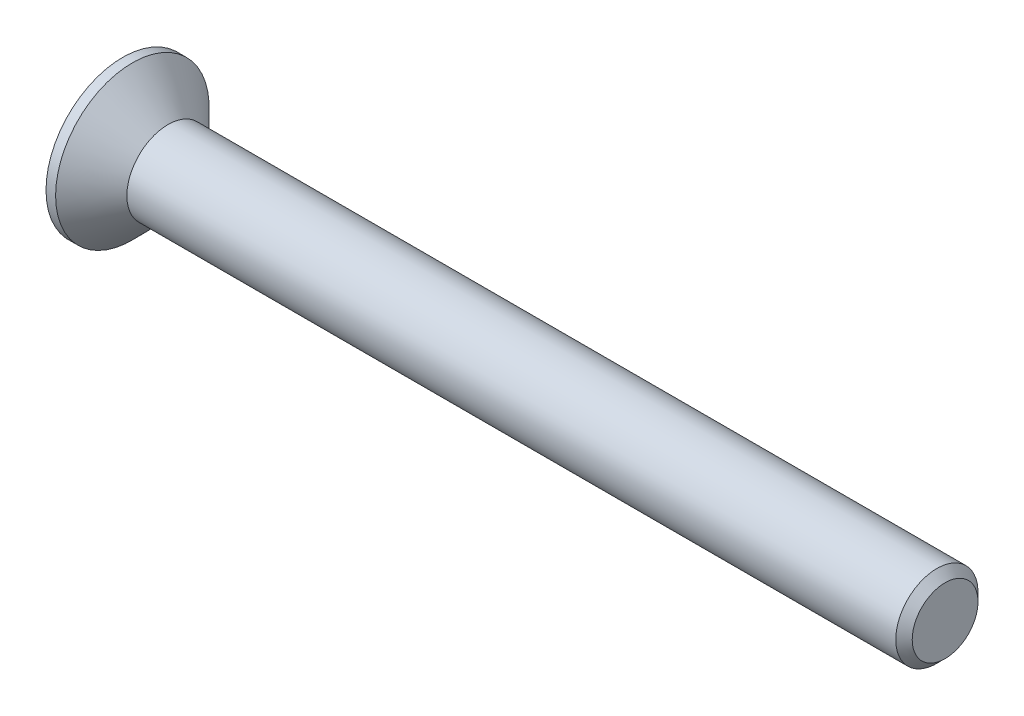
ISO-10303-21;
HEADER;
FILE_DESCRIPTION(('STEP AP214'),'2;1');
FILE_NAME('part.step','',(''),(''),'','','');
FILE_SCHEMA(('AUTOMOTIVE_DESIGN { 1 0 10303 214 1 1 1 1 }'));
ENDSEC;
DATA;
#1=APPLICATION_CONTEXT('core data for automotive mechanical design processes');
#2=APPLICATION_PROTOCOL_DEFINITION('international standard','automotive_design',2000,#1);
#3=PRODUCT_CONTEXT('',#1,'mechanical');
#4=PRODUCT('Part','Part','',(#3));
#5=PRODUCT_RELATED_PRODUCT_CATEGORY('part','',(#4));
#6=PRODUCT_DEFINITION_FORMATION('','',#4);
#7=PRODUCT_DEFINITION_CONTEXT('part definition',#1,'design');
#8=PRODUCT_DEFINITION('design','',#6,#7);
#9=PRODUCT_DEFINITION_SHAPE('','',#8);
#10=(LENGTH_UNIT() NAMED_UNIT(*) SI_UNIT(.MILLI.,.METRE.));
#11=(NAMED_UNIT(*) PLANE_ANGLE_UNIT() SI_UNIT($,.RADIAN.));
#12=(NAMED_UNIT(*) SI_UNIT($,.STERADIAN.) SOLID_ANGLE_UNIT());
#13=UNCERTAINTY_MEASURE_WITH_UNIT(LENGTH_MEASURE(1.E-05),#10,'distance_accuracy_value','');
#14=(GEOMETRIC_REPRESENTATION_CONTEXT(3) GLOBAL_UNCERTAINTY_ASSIGNED_CONTEXT((#13)) GLOBAL_UNIT_ASSIGNED_CONTEXT((#10,
#11,#12)) REPRESENTATION_CONTEXT('',''));
#15=CARTESIAN_POINT('',(0.,0.,0.));
#16=DIRECTION('',(0.,0.,1.));
#17=DIRECTION('',(1.,0.,0.));
#18=AXIS2_PLACEMENT_3D('',#15,#16,#17);
#19=CARTESIAN_POINT('',(0.,0.,0.));
#20=DIRECTION('',(-1.,0.,0.));
#21=DIRECTION('',(0.,0.,1.));
#22=AXIS2_PLACEMENT_3D('',#19,#20,#21);
#23=CONICAL_SURFACE('',#22,1.5,0.78539816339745);
#24=CARTESIAN_POINT('',(-1.3,0.,0.));
#25=DIRECTION('',(-1.,0.,0.));
#26=DIRECTION('',(0.,0.,1.));
#27=AXIS2_PLACEMENT_3D('',#24,#25,#26);
#28=CIRCLE('',#27,2.8);
#29=CARTESIAN_POINT('',(-1.3,0.,2.8));
#30=VERTEX_POINT('',#29);
#31=EDGE_CURVE('E189',#30,#30,#28,.T.);
#32=ORIENTED_EDGE('',*,*,#31,.F.);
#33=EDGE_LOOP('',(#32));
#34=FACE_BOUND('',#33,.T.);
#35=CARTESIAN_POINT('',(0.,0.,0.));
#36=DIRECTION('',(-1.,0.,0.));
#37=DIRECTION('',(0.,0.,1.));
#38=AXIS2_PLACEMENT_3D('',#35,#36,#37);
#39=CIRCLE('',#38,1.5);
#40=CARTESIAN_POINT('',(0.,0.,1.5));
#41=VERTEX_POINT('',#40);
#42=EDGE_CURVE('E212',#41,#41,#39,.T.);
#43=ORIENTED_EDGE('',*,*,#42,.T.);
#44=EDGE_LOOP('',(#43));
#45=FACE_BOUND('',#44,.T.);
#46=ADVANCED_FACE('F33',(#34,#45),#23,.T.);
#47=CARTESIAN_POINT('',(-1.65,0.,0.));
#48=DIRECTION('',(-1.,0.,0.));
#49=DIRECTION('',(0.,0.,1.));
#50=AXIS2_PLACEMENT_3D('',#47,#48,#49);
#51=CYLINDRICAL_SURFACE('',#50,1.5);
#52=CARTESIAN_POINT('',(28.05,0.,0.));
#53=DIRECTION('',(-1.,0.,0.));
#54=DIRECTION('',(0.,0.,1.));
#55=AXIS2_PLACEMENT_3D('',#52,#53,#54);
#56=CIRCLE('',#55,1.5);
#57=CARTESIAN_POINT('',(28.05,0.,1.5));
#58=VERTEX_POINT('',#57);
#59=EDGE_CURVE('E41',#58,#58,#56,.T.);
#60=ORIENTED_EDGE('',*,*,#59,.T.);
#61=EDGE_LOOP('',(#60));
#62=FACE_BOUND('',#61,.T.);
#63=ORIENTED_EDGE('',*,*,#42,.F.);
#64=EDGE_LOOP('',(#63));
#65=FACE_BOUND('',#64,.T.);
#66=ADVANCED_FACE('F217',(#62,#65),#51,.T.);
#67=CARTESIAN_POINT('',(28.35,0.,0.));
#68=DIRECTION('',(-1.,0.,0.));
#69=DIRECTION('',(0.,0.,1.));
#70=AXIS2_PLACEMENT_3D('',#67,#68,#69);
#71=PLANE('',#70);
#72=CARTESIAN_POINT('',(28.35,0.,0.));
#73=DIRECTION('',(-1.,0.,0.));
#74=DIRECTION('',(0.,0.,1.));
#75=AXIS2_PLACEMENT_3D('',#72,#73,#74);
#76=CIRCLE('',#75,1.19999999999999);
#77=CARTESIAN_POINT('',(28.35,0.,1.19999999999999));
#78=VERTEX_POINT('',#77);
#79=EDGE_CURVE('E11',#78,#78,#76,.F.);
#80=ORIENTED_EDGE('',*,*,#79,.T.);
#81=EDGE_LOOP('',(#80));
#82=FACE_BOUND('',#81,.T.);
#83=ADVANCED_FACE('F239',(#82),#71,.F.);
#84=CARTESIAN_POINT('',(-1.65,2.8,0.));
#85=DIRECTION('',(1.,0.,0.));
#86=DIRECTION('',(0.,0.,-1.));
#87=AXIS2_PLACEMENT_3D('',#84,#85,#86);
#88=PLANE('',#87);
#89=DIRECTION('',(0.,0.,-1.));
#90=VECTOR('',#89,1.);
#91=CARTESIAN_POINT('',(-1.65,0.365,-1.45));
#92=LINE('',#91,#90);
#93=CARTESIAN_POINT('',(-1.65,0.365,-0.365));
#94=VERTEX_POINT('',#93);
#95=CARTESIAN_POINT('',(-1.65,0.365,-1.45));
#96=VERTEX_POINT('',#95);
#97=EDGE_CURVE('E158',#94,#96,#92,.T.);
#98=ORIENTED_EDGE('',*,*,#97,.F.);
#99=DIRECTION('',(0.,-1.,0.));
#100=VECTOR('',#99,1.);
#101=CARTESIAN_POINT('',(-1.65,0.365,-0.365));
#102=LINE('',#101,#100);
#103=CARTESIAN_POINT('',(-1.65,1.45,-0.365));
#104=VERTEX_POINT('',#103);
#105=EDGE_CURVE('E48',#104,#94,#102,.T.);
#106=ORIENTED_EDGE('',*,*,#105,.F.);
#107=DIRECTION('',(0.,0.,-1.));
#108=VECTOR('',#107,1.);
#109=CARTESIAN_POINT('',(-1.65,1.45,-0.365));
#110=LINE('',#109,#108);
#111=CARTESIAN_POINT('',(-1.65,1.45,0.365));
#112=VERTEX_POINT('',#111);
#113=EDGE_CURVE('E185',#112,#104,#110,.T.);
#114=ORIENTED_EDGE('',*,*,#113,.F.);
#115=DIRECTION('',(0.,1.,0.));
#116=VECTOR('',#115,1.);
#117=CARTESIAN_POINT('',(-1.65,1.45,0.365));
#118=LINE('',#117,#116);
#119=CARTESIAN_POINT('',(-1.65,0.365,0.365));
#120=VERTEX_POINT('',#119);
#121=EDGE_CURVE('E183',#120,#112,#118,.T.);
#122=ORIENTED_EDGE('',*,*,#121,.F.);
#123=DIRECTION('',(0.,0.,-1.));
#124=VECTOR('',#123,1.);
#125=CARTESIAN_POINT('',(-1.65,0.365,0.365));
#126=LINE('',#125,#124);
#127=CARTESIAN_POINT('',(-1.65,0.365,1.45));
#128=VERTEX_POINT('',#127);
#129=EDGE_CURVE('E132',#128,#120,#126,.T.);
#130=ORIENTED_EDGE('',*,*,#129,.F.);
#131=DIRECTION('',(0.,1.,0.));
#132=VECTOR('',#131,1.);
#133=CARTESIAN_POINT('',(-1.65,0.365,1.45));
#134=LINE('',#133,#132);
#135=CARTESIAN_POINT('',(-1.65,-0.365,1.45));
#136=VERTEX_POINT('',#135);
#137=EDGE_CURVE('E179',#136,#128,#134,.T.);
#138=ORIENTED_EDGE('',*,*,#137,.F.);
#139=DIRECTION('',(0.,0.,1.));
#140=VECTOR('',#139,1.);
#141=CARTESIAN_POINT('',(-1.65,-0.365,1.45));
#142=LINE('',#141,#140);
#143=CARTESIAN_POINT('',(-1.65,-0.365,0.365));
#144=VERTEX_POINT('',#143);
#145=EDGE_CURVE('E176',#144,#136,#142,.T.);
#146=ORIENTED_EDGE('',*,*,#145,.F.);
#147=DIRECTION('',(0.,1.,0.));
#148=VECTOR('',#147,1.);
#149=CARTESIAN_POINT('',(-1.65,-0.365,0.365));
#150=LINE('',#149,#148);
#151=CARTESIAN_POINT('',(-1.65,-1.45,0.365));
#152=VERTEX_POINT('',#151);
#153=EDGE_CURVE('E173',#152,#144,#150,.T.);
#154=ORIENTED_EDGE('',*,*,#153,.F.);
#155=DIRECTION('',(0.,0.,1.));
#156=VECTOR('',#155,1.);
#157=CARTESIAN_POINT('',(-1.65,-1.45,0.365));
#158=LINE('',#157,#156);
#159=CARTESIAN_POINT('',(-1.65,-1.45,-0.365));
#160=VERTEX_POINT('',#159);
#161=EDGE_CURVE('E170',#160,#152,#158,.T.);
#162=ORIENTED_EDGE('',*,*,#161,.F.);
#163=DIRECTION('',(0.,-1.,0.));
#164=VECTOR('',#163,1.);
#165=CARTESIAN_POINT('',(-1.65,-1.45,-0.365));
#166=LINE('',#165,#164);
#167=CARTESIAN_POINT('',(-1.65,-0.365,-0.365));
#168=VERTEX_POINT('',#167);
#169=EDGE_CURVE('E167',#168,#160,#166,.T.);
#170=ORIENTED_EDGE('',*,*,#169,.F.);
#171=DIRECTION('',(0.,0.,1.));
#172=VECTOR('',#171,1.);
#173=CARTESIAN_POINT('',(-1.65,-0.365,-0.365));
#174=LINE('',#173,#172);
#175=CARTESIAN_POINT('',(-1.65,-0.365,-1.45));
#176=VERTEX_POINT('',#175);
#177=EDGE_CURVE('E164',#176,#168,#174,.T.);
#178=ORIENTED_EDGE('',*,*,#177,.F.);
#179=DIRECTION('',(0.,-1.,0.));
#180=VECTOR('',#179,1.);
#181=CARTESIAN_POINT('',(-1.65,-0.365,-1.45));
#182=LINE('',#181,#180);
#183=EDGE_CURVE('E161',#96,#176,#182,.T.);
#184=ORIENTED_EDGE('',*,*,#183,.F.);
#185=EDGE_LOOP('',(#98,#106,#114,#122,#130,#138,#146,#154,#162,#170,#178,#184));
#186=FACE_BOUND('',#185,.T.);
#187=CARTESIAN_POINT('',(-1.65,0.,0.));
#188=DIRECTION('',(-1.,0.,0.));
#189=DIRECTION('',(0.,0.,1.));
#190=AXIS2_PLACEMENT_3D('',#187,#188,#189);
#191=CIRCLE('',#190,2.8);
#192=CARTESIAN_POINT('',(-1.65,0.,2.8));
#193=VERTEX_POINT('',#192);
#194=EDGE_CURVE('E209',#193,#193,#191,.T.);
#195=ORIENTED_EDGE('',*,*,#194,.T.);
#196=EDGE_LOOP('',(#195));
#197=FACE_BOUND('',#196,.T.);
#198=ADVANCED_FACE('F230',(#186,#197),#88,.F.);
#199=CARTESIAN_POINT('',(-1.65,0.,0.));
#200=DIRECTION('',(-1.,0.,0.));
#201=DIRECTION('',(0.,0.,1.));
#202=AXIS2_PLACEMENT_3D('',#199,#200,#201);
#203=CYLINDRICAL_SURFACE('',#202,2.8);
#204=ORIENTED_EDGE('',*,*,#194,.F.);
#205=EDGE_LOOP('',(#204));
#206=FACE_BOUND('',#205,.T.);
#207=ORIENTED_EDGE('',*,*,#31,.T.);
#208=EDGE_LOOP('',(#207));
#209=FACE_BOUND('',#208,.T.);
#210=ADVANCED_FACE('F222',(#206,#209),#203,.T.);
#211=CARTESIAN_POINT('',(28.05,0.,0.));
#212=DIRECTION('',(-1.,0.,0.));
#213=DIRECTION('',(0.,0.,1.));
#214=AXIS2_PLACEMENT_3D('',#211,#212,#213);
#215=CONICAL_SURFACE('',#214,1.5,0.785398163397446);
#216=ORIENTED_EDGE('',*,*,#79,.F.);
#217=EDGE_LOOP('',(#216));
#218=FACE_BOUND('',#217,.T.);
#219=ORIENTED_EDGE('',*,*,#59,.F.);
#220=EDGE_LOOP('',(#219));
#221=FACE_BOUND('',#220,.T.);
#222=ADVANCED_FACE('F35',(#218,#221),#215,.T.);
#223=CARTESIAN_POINT('',(-0.4,0.365,-0.365));
#224=DIRECTION('',(0.,0.,-1.));
#225=DIRECTION('',(-1.,0.,0.));
#226=AXIS2_PLACEMENT_3D('',#223,#224,#225);
#227=PLANE('',#226);
#228=ORIENTED_EDGE('',*,*,#105,.T.);
#229=DIRECTION('',(-1.,0.,0.));
#230=VECTOR('',#229,1.);
#231=CARTESIAN_POINT('',(-0.4,0.365,-0.365));
#232=LINE('',#231,#230);
#233=CARTESIAN_POINT('',(-0.4,0.365,-0.365));
#234=VERTEX_POINT('',#233);
#235=EDGE_CURVE('E96',#234,#94,#232,.T.);
#236=ORIENTED_EDGE('',*,*,#235,.F.);
#237=DIRECTION('',(0.,-1.,0.));
#238=VECTOR('',#237,1.);
#239=CARTESIAN_POINT('',(-0.4,0.365,-0.365));
#240=LINE('',#239,#238);
#241=CARTESIAN_POINT('',(-0.4,1.45,-0.365));
#242=VERTEX_POINT('',#241);
#243=EDGE_CURVE('E187',#242,#234,#240,.T.);
#244=ORIENTED_EDGE('',*,*,#243,.F.);
#245=DIRECTION('',(-1.,0.,0.));
#246=VECTOR('',#245,1.);
#247=CARTESIAN_POINT('',(-0.4,1.45,-0.365));
#248=LINE('',#247,#246);
#249=EDGE_CURVE('E56',#242,#104,#248,.T.);
#250=ORIENTED_EDGE('',*,*,#249,.T.);
#251=EDGE_LOOP('',(#228,#236,#244,#250));
#252=FACE_BOUND('',#251,.T.);
#253=ADVANCED_FACE('F221',(#252),#227,.F.);
#254=CARTESIAN_POINT('',(-0.4,1.45,-0.365));
#255=DIRECTION('',(0.,1.,0.));
#256=DIRECTION('',(-1.,0.,0.));
#257=AXIS2_PLACEMENT_3D('',#254,#255,#256);
#258=PLANE('',#257);
#259=ORIENTED_EDGE('',*,*,#113,.T.);
#260=ORIENTED_EDGE('',*,*,#249,.F.);
#261=DIRECTION('',(0.,0.,-1.));
#262=VECTOR('',#261,1.);
#263=CARTESIAN_POINT('',(-0.4,1.45,-0.365));
#264=LINE('',#263,#262);
#265=CARTESIAN_POINT('',(-0.4,1.45,0.365));
#266=VERTEX_POINT('',#265);
#267=EDGE_CURVE('E144',#266,#242,#264,.T.);
#268=ORIENTED_EDGE('',*,*,#267,.F.);
#269=DIRECTION('',(-1.,0.,0.));
#270=VECTOR('',#269,1.);
#271=CARTESIAN_POINT('',(-0.4,1.45,0.365));
#272=LINE('',#271,#270);
#273=EDGE_CURVE('E136',#266,#112,#272,.T.);
#274=ORIENTED_EDGE('',*,*,#273,.T.);
#275=EDGE_LOOP('',(#259,#260,#268,#274));
#276=FACE_BOUND('',#275,.T.);
#277=ADVANCED_FACE('F228',(#276),#258,.F.);
#278=CARTESIAN_POINT('',(-0.4,1.45,0.365));
#279=DIRECTION('',(0.,0.,1.));
#280=DIRECTION('',(1.,0.,0.));
#281=AXIS2_PLACEMENT_3D('',#278,#279,#280);
#282=PLANE('',#281);
#283=ORIENTED_EDGE('',*,*,#121,.T.);
#284=ORIENTED_EDGE('',*,*,#273,.F.);
#285=DIRECTION('',(0.,1.,0.));
#286=VECTOR('',#285,1.);
#287=CARTESIAN_POINT('',(-0.4,1.45,0.365));
#288=LINE('',#287,#286);
#289=CARTESIAN_POINT('',(-0.4,0.365,0.365));
#290=VERTEX_POINT('',#289);
#291=EDGE_CURVE('E140',#290,#266,#288,.T.);
#292=ORIENTED_EDGE('',*,*,#291,.F.);
#293=DIRECTION('',(-1.,0.,0.));
#294=VECTOR('',#293,1.);
#295=CARTESIAN_POINT('',(-0.4,0.365,0.365));
#296=LINE('',#295,#294);
#297=EDGE_CURVE('E125',#290,#120,#296,.T.);
#298=ORIENTED_EDGE('',*,*,#297,.T.);
#299=EDGE_LOOP('',(#283,#284,#292,#298));
#300=FACE_BOUND('',#299,.T.);
#301=ADVANCED_FACE('F141',(#300),#282,.F.);
#302=CARTESIAN_POINT('',(-0.4,0.365,0.365));
#303=DIRECTION('',(0.,1.,0.));
#304=DIRECTION('',(-1.,0.,0.));
#305=AXIS2_PLACEMENT_3D('',#302,#303,#304);
#306=PLANE('',#305);
#307=ORIENTED_EDGE('',*,*,#129,.T.);
#308=ORIENTED_EDGE('',*,*,#297,.F.);
#309=DIRECTION('',(0.,0.,-1.));
#310=VECTOR('',#309,1.);
#311=CARTESIAN_POINT('',(-0.4,0.365,0.365));
#312=LINE('',#311,#310);
#313=CARTESIAN_POINT('',(-0.4,0.365,1.45));
#314=VERTEX_POINT('',#313);
#315=EDGE_CURVE('E129',#314,#290,#312,.T.);
#316=ORIENTED_EDGE('',*,*,#315,.F.);
#317=DIRECTION('',(-1.,0.,0.));
#318=VECTOR('',#317,1.);
#319=CARTESIAN_POINT('',(-0.4,0.365,1.45));
#320=LINE('',#319,#318);
#321=EDGE_CURVE('E137',#314,#128,#320,.T.);
#322=ORIENTED_EDGE('',*,*,#321,.T.);
#323=EDGE_LOOP('',(#307,#308,#316,#322));
#324=FACE_BOUND('',#323,.T.);
#325=ADVANCED_FACE('F127',(#324),#306,.F.);
#326=CARTESIAN_POINT('',(-0.4,0.365,1.45));
#327=DIRECTION('',(0.,0.,1.));
#328=DIRECTION('',(1.,0.,0.));
#329=AXIS2_PLACEMENT_3D('',#326,#327,#328);
#330=PLANE('',#329);
#331=ORIENTED_EDGE('',*,*,#137,.T.);
#332=ORIENTED_EDGE('',*,*,#321,.F.);
#333=DIRECTION('',(0.,1.,0.));
#334=VECTOR('',#333,1.);
#335=CARTESIAN_POINT('',(-0.4,0.365,1.45));
#336=LINE('',#335,#334);
#337=CARTESIAN_POINT('',(-0.4,-0.365,1.45));
#338=VERTEX_POINT('',#337);
#339=EDGE_CURVE('E150',#338,#314,#336,.T.);
#340=ORIENTED_EDGE('',*,*,#339,.F.);
#341=DIRECTION('',(-1.,0.,0.));
#342=VECTOR('',#341,1.);
#343=CARTESIAN_POINT('',(-0.4,-0.365,1.45));
#344=LINE('',#343,#342);
#345=EDGE_CURVE('E192',#338,#136,#344,.T.);
#346=ORIENTED_EDGE('',*,*,#345,.T.);
#347=EDGE_LOOP('',(#331,#332,#340,#346));
#348=FACE_BOUND('',#347,.T.);
#349=ADVANCED_FACE('F277',(#348),#330,.F.);
#350=CARTESIAN_POINT('',(-0.4,-0.365,1.45));
#351=DIRECTION('',(0.,-1.,0.));
#352=DIRECTION('',(1.,0.,0.));
#353=AXIS2_PLACEMENT_3D('',#350,#351,#352);
#354=PLANE('',#353);
#355=ORIENTED_EDGE('',*,*,#145,.T.);
#356=ORIENTED_EDGE('',*,*,#345,.F.);
#357=DIRECTION('',(0.,0.,1.));
#358=VECTOR('',#357,1.);
#359=CARTESIAN_POINT('',(-0.4,-0.365,1.45));
#360=LINE('',#359,#358);
#361=CARTESIAN_POINT('',(-0.4,-0.365,0.365));
#362=VERTEX_POINT('',#361);
#363=EDGE_CURVE('E152',#362,#338,#360,.T.);
#364=ORIENTED_EDGE('',*,*,#363,.F.);
#365=DIRECTION('',(-1.,0.,0.));
#366=VECTOR('',#365,1.);
#367=CARTESIAN_POINT('',(-0.4,-0.365,0.365));
#368=LINE('',#367,#366);
#369=EDGE_CURVE('E194',#362,#144,#368,.T.);
#370=ORIENTED_EDGE('',*,*,#369,.T.);
#371=EDGE_LOOP('',(#355,#356,#364,#370));
#372=FACE_BOUND('',#371,.T.);
#373=ADVANCED_FACE('F273',(#372),#354,.F.);
#374=CARTESIAN_POINT('',(-0.4,-0.365,0.365));
#375=DIRECTION('',(0.,0.,1.));
#376=DIRECTION('',(1.,0.,0.));
#377=AXIS2_PLACEMENT_3D('',#374,#375,#376);
#378=PLANE('',#377);
#379=ORIENTED_EDGE('',*,*,#153,.T.);
#380=ORIENTED_EDGE('',*,*,#369,.F.);
#381=DIRECTION('',(0.,1.,0.));
#382=VECTOR('',#381,1.);
#383=CARTESIAN_POINT('',(-0.4,-0.365,0.365));
#384=LINE('',#383,#382);
#385=CARTESIAN_POINT('',(-0.4,-1.45,0.365));
#386=VERTEX_POINT('',#385);
#387=EDGE_CURVE('E422',#386,#362,#384,.T.);
#388=ORIENTED_EDGE('',*,*,#387,.F.);
#389=DIRECTION('',(-1.,0.,0.));
#390=VECTOR('',#389,1.);
#391=CARTESIAN_POINT('',(-0.4,-1.45,0.365));
#392=LINE('',#391,#390);
#393=EDGE_CURVE('E196',#386,#152,#392,.T.);
#394=ORIENTED_EDGE('',*,*,#393,.T.);
#395=EDGE_LOOP('',(#379,#380,#388,#394));
#396=FACE_BOUND('',#395,.T.);
#397=ADVANCED_FACE('F269',(#396),#378,.F.);
#398=CARTESIAN_POINT('',(-0.4,-1.45,0.365));
#399=DIRECTION('',(0.,-1.,0.));
#400=DIRECTION('',(1.,0.,0.));
#401=AXIS2_PLACEMENT_3D('',#398,#399,#400);
#402=PLANE('',#401);
#403=ORIENTED_EDGE('',*,*,#161,.T.);
#404=ORIENTED_EDGE('',*,*,#393,.F.);
#405=DIRECTION('',(0.,0.,1.));
#406=VECTOR('',#405,1.);
#407=CARTESIAN_POINT('',(-0.4,-1.45,0.365));
#408=LINE('',#407,#406);
#409=CARTESIAN_POINT('',(-0.4,-1.45,-0.365));
#410=VERTEX_POINT('',#409);
#411=EDGE_CURVE('E419',#410,#386,#408,.T.);
#412=ORIENTED_EDGE('',*,*,#411,.F.);
#413=DIRECTION('',(-1.,0.,0.));
#414=VECTOR('',#413,1.);
#415=CARTESIAN_POINT('',(-0.4,-1.45,-0.365));
#416=LINE('',#415,#414);
#417=EDGE_CURVE('E198',#410,#160,#416,.T.);
#418=ORIENTED_EDGE('',*,*,#417,.T.);
#419=EDGE_LOOP('',(#403,#404,#412,#418));
#420=FACE_BOUND('',#419,.T.);
#421=ADVANCED_FACE('F265',(#420),#402,.F.);
#422=CARTESIAN_POINT('',(-0.4,-1.45,-0.365));
#423=DIRECTION('',(0.,0.,-1.));
#424=DIRECTION('',(-1.,0.,0.));
#425=AXIS2_PLACEMENT_3D('',#422,#423,#424);
#426=PLANE('',#425);
#427=ORIENTED_EDGE('',*,*,#169,.T.);
#428=ORIENTED_EDGE('',*,*,#417,.F.);
#429=DIRECTION('',(0.,-1.,0.));
#430=VECTOR('',#429,1.);
#431=CARTESIAN_POINT('',(-0.4,-1.45,-0.365));
#432=LINE('',#431,#430);
#433=CARTESIAN_POINT('',(-0.4,-0.365,-0.365));
#434=VERTEX_POINT('',#433);
#435=EDGE_CURVE('E416',#434,#410,#432,.T.);
#436=ORIENTED_EDGE('',*,*,#435,.F.);
#437=DIRECTION('',(-1.,0.,0.));
#438=VECTOR('',#437,1.);
#439=CARTESIAN_POINT('',(-0.4,-0.365,-0.365));
#440=LINE('',#439,#438);
#441=EDGE_CURVE('E200',#434,#168,#440,.T.);
#442=ORIENTED_EDGE('',*,*,#441,.T.);
#443=EDGE_LOOP('',(#427,#428,#436,#442));
#444=FACE_BOUND('',#443,.T.);
#445=ADVANCED_FACE('F261',(#444),#426,.F.);
#446=CARTESIAN_POINT('',(-0.4,-0.365,-0.365));
#447=DIRECTION('',(0.,-1.,0.));
#448=DIRECTION('',(1.,0.,0.));
#449=AXIS2_PLACEMENT_3D('',#446,#447,#448);
#450=PLANE('',#449);
#451=ORIENTED_EDGE('',*,*,#177,.T.);
#452=ORIENTED_EDGE('',*,*,#441,.F.);
#453=DIRECTION('',(0.,0.,1.));
#454=VECTOR('',#453,1.);
#455=CARTESIAN_POINT('',(-0.4,-0.365,-0.365));
#456=LINE('',#455,#454);
#457=CARTESIAN_POINT('',(-0.4,-0.365,-1.45));
#458=VERTEX_POINT('',#457);
#459=EDGE_CURVE('E413',#458,#434,#456,.T.);
#460=ORIENTED_EDGE('',*,*,#459,.F.);
#461=DIRECTION('',(-1.,0.,0.));
#462=VECTOR('',#461,1.);
#463=CARTESIAN_POINT('',(-0.4,-0.365,-1.45));
#464=LINE('',#463,#462);
#465=EDGE_CURVE('E202',#458,#176,#464,.T.);
#466=ORIENTED_EDGE('',*,*,#465,.T.);
#467=EDGE_LOOP('',(#451,#452,#460,#466));
#468=FACE_BOUND('',#467,.T.);
#469=ADVANCED_FACE('F257',(#468),#450,.F.);
#470=CARTESIAN_POINT('',(-0.4,-0.365,-1.45));
#471=DIRECTION('',(0.,0.,-1.));
#472=DIRECTION('',(-1.,0.,0.));
#473=AXIS2_PLACEMENT_3D('',#470,#471,#472);
#474=PLANE('',#473);
#475=ORIENTED_EDGE('',*,*,#183,.T.);
#476=ORIENTED_EDGE('',*,*,#465,.F.);
#477=DIRECTION('',(0.,-1.,0.));
#478=VECTOR('',#477,1.);
#479=CARTESIAN_POINT('',(-0.4,-0.365,-1.45));
#480=LINE('',#479,#478);
#481=CARTESIAN_POINT('',(-0.4,0.365,-1.45));
#482=VERTEX_POINT('',#481);
#483=EDGE_CURVE('E408',#482,#458,#480,.T.);
#484=ORIENTED_EDGE('',*,*,#483,.F.);
#485=DIRECTION('',(-1.,0.,0.));
#486=VECTOR('',#485,1.);
#487=CARTESIAN_POINT('',(-0.4,0.365,-1.45));
#488=LINE('',#487,#486);
#489=EDGE_CURVE('E204',#482,#96,#488,.T.);
#490=ORIENTED_EDGE('',*,*,#489,.T.);
#491=EDGE_LOOP('',(#475,#476,#484,#490));
#492=FACE_BOUND('',#491,.T.);
#493=ADVANCED_FACE('F253',(#492),#474,.F.);
#494=CARTESIAN_POINT('',(-0.4,0.365,-1.45));
#495=DIRECTION('',(0.,1.,0.));
#496=DIRECTION('',(-1.,0.,0.));
#497=AXIS2_PLACEMENT_3D('',#494,#495,#496);
#498=PLANE('',#497);
#499=ORIENTED_EDGE('',*,*,#97,.T.);
#500=ORIENTED_EDGE('',*,*,#489,.F.);
#501=DIRECTION('',(0.,0.,-1.));
#502=VECTOR('',#501,1.);
#503=CARTESIAN_POINT('',(-0.4,0.365,-1.45));
#504=LINE('',#503,#502);
#505=EDGE_CURVE('E406',#234,#482,#504,.T.);
#506=ORIENTED_EDGE('',*,*,#505,.F.);
#507=ORIENTED_EDGE('',*,*,#235,.T.);
#508=EDGE_LOOP('',(#499,#500,#506,#507));
#509=FACE_BOUND('',#508,.T.);
#510=ADVANCED_FACE('F250',(#509),#498,.F.);
#511=CARTESIAN_POINT('',(-0.4,0.,0.));
#512=DIRECTION('',(1.,0.,0.));
#513=DIRECTION('',(0.,0.,-1.));
#514=AXIS2_PLACEMENT_3D('',#511,#512,#513);
#515=PLANE('',#514);
#516=ORIENTED_EDGE('',*,*,#243,.T.);
#517=ORIENTED_EDGE('',*,*,#505,.T.);
#518=ORIENTED_EDGE('',*,*,#483,.T.);
#519=ORIENTED_EDGE('',*,*,#459,.T.);
#520=ORIENTED_EDGE('',*,*,#435,.T.);
#521=ORIENTED_EDGE('',*,*,#411,.T.);
#522=ORIENTED_EDGE('',*,*,#387,.T.);
#523=ORIENTED_EDGE('',*,*,#363,.T.);
#524=ORIENTED_EDGE('',*,*,#339,.T.);
#525=ORIENTED_EDGE('',*,*,#315,.T.);
#526=ORIENTED_EDGE('',*,*,#291,.T.);
#527=ORIENTED_EDGE('',*,*,#267,.T.);
#528=EDGE_LOOP('',(#516,#517,#518,#519,#520,#521,#522,#523,#524,#525,#526,#527));
#529=FACE_BOUND('',#528,.T.);
#530=ADVANCED_FACE('F147',(#529),#515,.F.);
#531=CLOSED_SHELL('',(#46,#66,#83,#198,#210,#222,#253,#277,#301,#325,#349,#373,#397,#421,#445,
#469,#493,#510,#530));
#532=MANIFOLD_SOLID_BREP('B2',#531);
#533=ADVANCED_BREP_SHAPE_REPRESENTATION('',(#18,#532),#14);
#534=SHAPE_DEFINITION_REPRESENTATION(#9,#533);
ENDSEC;
END-ISO-10303-21;
